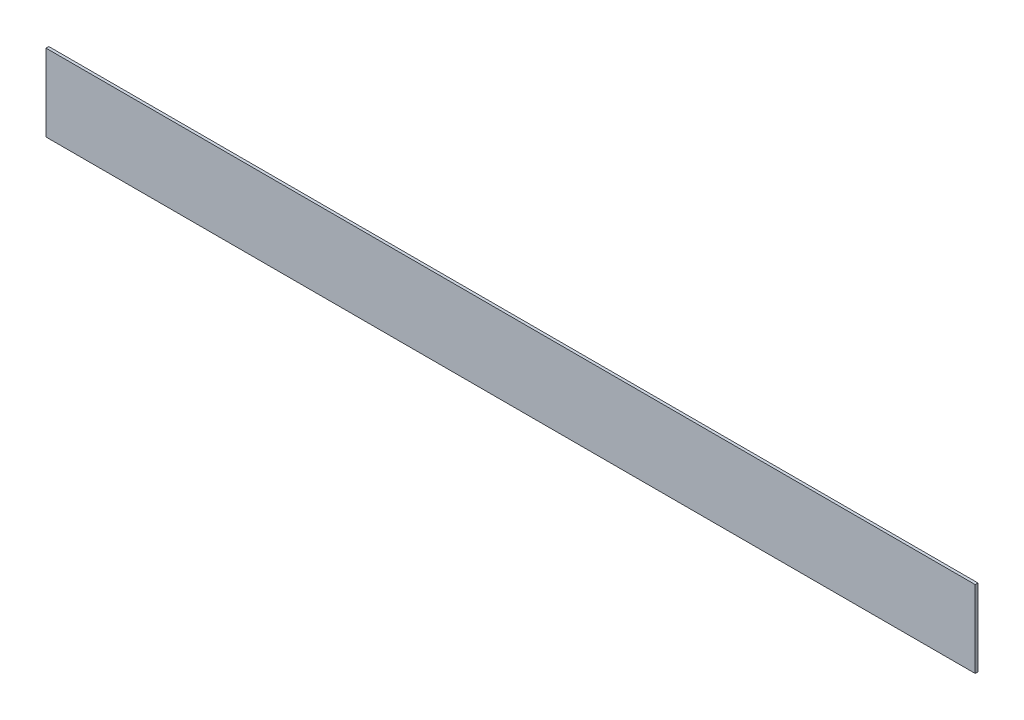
from build123d import *

# Parameters (mm, degrees)
CROQUIS1_W              = 5000
CROQUIS1_H              = 414.27
SALIENTE_EXTRUIR1_DEPTH = 15


with BuildPart() as part:
    # Croquis1 → Saliente-Extruir1 (new body)
    with BuildSketch(Plane.XY):
        with Locations((2727.893120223, -868.83688564)):
            Rectangle(CROQUIS1_W, CROQUIS1_H)
    extrude(amount=SALIENTE_EXTRUIR1_DEPTH)


solid = part.part
